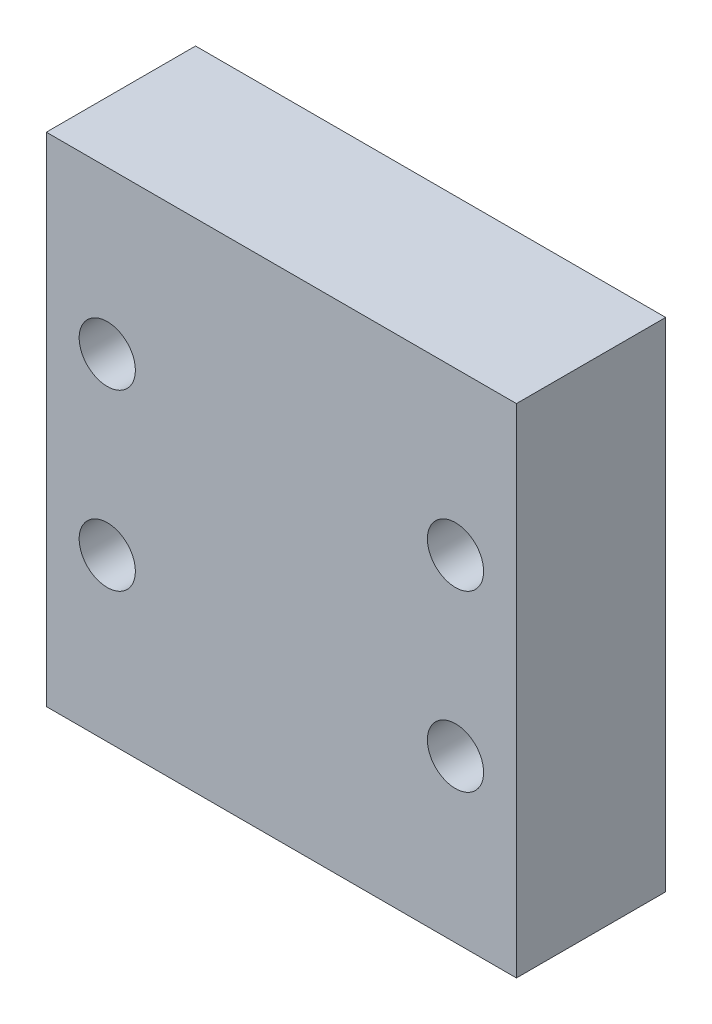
ISO-10303-21;
HEADER;
FILE_DESCRIPTION(('STEP AP214'),'2;1');
FILE_NAME('part.step','',(''),(''),'','','');
FILE_SCHEMA(('AUTOMOTIVE_DESIGN { 1 0 10303 214 1 1 1 1 }'));
ENDSEC;
DATA;
#1=APPLICATION_CONTEXT('core data for automotive mechanical design processes');
#2=APPLICATION_PROTOCOL_DEFINITION('international standard','automotive_design',2000,#1);
#3=PRODUCT_CONTEXT('',#1,'mechanical');
#4=PRODUCT('Part','Part','',(#3));
#5=PRODUCT_RELATED_PRODUCT_CATEGORY('part','',(#4));
#6=PRODUCT_DEFINITION_FORMATION('','',#4);
#7=PRODUCT_DEFINITION_CONTEXT('part definition',#1,'design');
#8=PRODUCT_DEFINITION('design','',#6,#7);
#9=PRODUCT_DEFINITION_SHAPE('','',#8);
#10=(LENGTH_UNIT() NAMED_UNIT(*) SI_UNIT(.MILLI.,.METRE.));
#11=(NAMED_UNIT(*) PLANE_ANGLE_UNIT() SI_UNIT($,.RADIAN.));
#12=(NAMED_UNIT(*) SI_UNIT($,.STERADIAN.) SOLID_ANGLE_UNIT());
#13=UNCERTAINTY_MEASURE_WITH_UNIT(LENGTH_MEASURE(1.E-05),#10,'distance_accuracy_value','');
#14=(GEOMETRIC_REPRESENTATION_CONTEXT(3) GLOBAL_UNCERTAINTY_ASSIGNED_CONTEXT((#13)) GLOBAL_UNIT_ASSIGNED_CONTEXT((#10,
#11,#12)) REPRESENTATION_CONTEXT('',''));
#15=CARTESIAN_POINT('',(0.,0.,0.));
#16=DIRECTION('',(0.,0.,1.));
#17=DIRECTION('',(1.,0.,0.));
#18=AXIS2_PLACEMENT_3D('',#15,#16,#17);
#19=CARTESIAN_POINT('',(0.,0.,6.));
#20=DIRECTION('',(0.,0.,-1.));
#21=DIRECTION('',(-1.,0.,0.));
#22=AXIS2_PLACEMENT_3D('',#19,#20,#21);
#23=PLANE('',#22);
#24=DIRECTION('',(0.,-1.,0.));
#25=VECTOR('',#24,1.);
#26=CARTESIAN_POINT('',(0.,0.,6.));
#27=LINE('',#26,#25);
#28=CARTESIAN_POINT('',(0.,20.,6.));
#29=VERTEX_POINT('',#28);
#30=CARTESIAN_POINT('',(0.,0.,6.));
#31=VERTEX_POINT('',#30);
#32=EDGE_CURVE('E85',#29,#31,#27,.T.);
#33=ORIENTED_EDGE('',*,*,#32,.T.);
#34=DIRECTION('',(1.,0.,0.));
#35=VECTOR('',#34,1.);
#36=CARTESIAN_POINT('',(0.,0.,6.));
#37=LINE('',#36,#35);
#38=CARTESIAN_POINT('',(18.9,0.,6.));
#39=VERTEX_POINT('',#38);
#40=EDGE_CURVE('E80',#31,#39,#37,.T.);
#41=ORIENTED_EDGE('',*,*,#40,.T.);
#42=DIRECTION('',(0.,1.,0.));
#43=VECTOR('',#42,1.);
#44=CARTESIAN_POINT('',(18.9,0.,6.));
#45=LINE('',#44,#43);
#46=CARTESIAN_POINT('',(18.9,20.,6.));
#47=VERTEX_POINT('',#46);
#48=EDGE_CURVE('E83',#39,#47,#45,.T.);
#49=ORIENTED_EDGE('',*,*,#48,.T.);
#50=DIRECTION('',(-1.,0.,0.));
#51=VECTOR('',#50,1.);
#52=CARTESIAN_POINT('',(0.,20.,6.));
#53=LINE('',#52,#51);
#54=EDGE_CURVE('E50',#47,#29,#53,.T.);
#55=ORIENTED_EDGE('',*,*,#54,.T.);
#56=EDGE_LOOP('',(#33,#41,#49,#55));
#57=FACE_BOUND('',#56,.T.);
#58=CARTESIAN_POINT('',(2.45,6.5,6.));
#59=DIRECTION('',(0.,0.,1.));
#60=DIRECTION('',(1.,0.,0.));
#61=AXIS2_PLACEMENT_3D('',#58,#59,#60);
#62=CIRCLE('',#61,1.13);
#63=CARTESIAN_POINT('',(3.58,6.5,6.));
#64=VERTEX_POINT('',#63);
#65=EDGE_CURVE('E100',#64,#64,#62,.T.);
#66=ORIENTED_EDGE('',*,*,#65,.F.);
#67=EDGE_LOOP('',(#66));
#68=FACE_BOUND('',#67,.T.);
#69=CARTESIAN_POINT('',(2.45,13.5,6.));
#70=DIRECTION('',(0.,0.,1.));
#71=DIRECTION('',(1.,0.,0.));
#72=AXIS2_PLACEMENT_3D('',#69,#70,#71);
#73=CIRCLE('',#72,1.13);
#74=CARTESIAN_POINT('',(3.58,13.5,6.));
#75=VERTEX_POINT('',#74);
#76=EDGE_CURVE('E115',#75,#75,#73,.T.);
#77=ORIENTED_EDGE('',*,*,#76,.F.);
#78=EDGE_LOOP('',(#77));
#79=FACE_BOUND('',#78,.T.);
#80=CARTESIAN_POINT('',(16.45,13.5,6.));
#81=DIRECTION('',(0.,0.,1.));
#82=DIRECTION('',(1.,0.,0.));
#83=AXIS2_PLACEMENT_3D('',#80,#81,#82);
#84=CIRCLE('',#83,1.13);
#85=CARTESIAN_POINT('',(17.58,13.5,6.));
#86=VERTEX_POINT('',#85);
#87=EDGE_CURVE('E121',#86,#86,#84,.T.);
#88=ORIENTED_EDGE('',*,*,#87,.F.);
#89=EDGE_LOOP('',(#88));
#90=FACE_BOUND('',#89,.T.);
#91=CARTESIAN_POINT('',(16.45,6.5,6.));
#92=DIRECTION('',(0.,0.,1.));
#93=DIRECTION('',(1.,0.,0.));
#94=AXIS2_PLACEMENT_3D('',#91,#92,#93);
#95=CIRCLE('',#94,1.13);
#96=CARTESIAN_POINT('',(17.58,6.5,6.));
#97=VERTEX_POINT('',#96);
#98=EDGE_CURVE('E127',#97,#97,#95,.T.);
#99=ORIENTED_EDGE('',*,*,#98,.F.);
#100=EDGE_LOOP('',(#99));
#101=FACE_BOUND('',#100,.T.);
#102=ADVANCED_FACE('F33',(#57,#68,#79,#90,#101),#23,.F.);
#103=CARTESIAN_POINT('',(0.,0.,0.));
#104=DIRECTION('',(0.,0.,-1.));
#105=DIRECTION('',(-1.,0.,0.));
#106=AXIS2_PLACEMENT_3D('',#103,#104,#105);
#107=PLANE('',#106);
#108=CARTESIAN_POINT('',(16.45,13.5,0.));
#109=DIRECTION('',(0.,0.,1.));
#110=DIRECTION('',(1.,0.,0.));
#111=AXIS2_PLACEMENT_3D('',#108,#109,#110);
#112=CIRCLE('',#111,1.13);
#113=CARTESIAN_POINT('',(17.58,13.5,0.));
#114=VERTEX_POINT('',#113);
#115=EDGE_CURVE('E124',#114,#114,#112,.T.);
#116=ORIENTED_EDGE('',*,*,#115,.T.);
#117=EDGE_LOOP('',(#116));
#118=FACE_BOUND('',#117,.T.);
#119=CARTESIAN_POINT('',(2.45,6.5,0.));
#120=DIRECTION('',(0.,0.,1.));
#121=DIRECTION('',(1.,0.,0.));
#122=AXIS2_PLACEMENT_3D('',#119,#120,#121);
#123=CIRCLE('',#122,1.13);
#124=CARTESIAN_POINT('',(3.58,6.5,0.));
#125=VERTEX_POINT('',#124);
#126=EDGE_CURVE('E112',#125,#125,#123,.T.);
#127=ORIENTED_EDGE('',*,*,#126,.T.);
#128=EDGE_LOOP('',(#127));
#129=FACE_BOUND('',#128,.T.);
#130=DIRECTION('',(0.,-1.,0.));
#131=VECTOR('',#130,1.);
#132=CARTESIAN_POINT('',(0.,0.,0.));
#133=LINE('',#132,#131);
#134=CARTESIAN_POINT('',(0.,20.,0.));
#135=VERTEX_POINT('',#134);
#136=CARTESIAN_POINT('',(0.,0.,0.));
#137=VERTEX_POINT('',#136);
#138=EDGE_CURVE('E97',#135,#137,#133,.T.);
#139=ORIENTED_EDGE('',*,*,#138,.F.);
#140=DIRECTION('',(-1.,0.,0.));
#141=VECTOR('',#140,1.);
#142=CARTESIAN_POINT('',(0.,20.,0.));
#143=LINE('',#142,#141);
#144=CARTESIAN_POINT('',(18.9,20.,0.));
#145=VERTEX_POINT('',#144);
#146=EDGE_CURVE('E73',#145,#135,#143,.T.);
#147=ORIENTED_EDGE('',*,*,#146,.F.);
#148=DIRECTION('',(0.,1.,0.));
#149=VECTOR('',#148,1.);
#150=CARTESIAN_POINT('',(18.9,0.,0.));
#151=LINE('',#150,#149);
#152=CARTESIAN_POINT('',(18.9,0.,0.));
#153=VERTEX_POINT('',#152);
#154=EDGE_CURVE('E67',#153,#145,#151,.T.);
#155=ORIENTED_EDGE('',*,*,#154,.F.);
#156=DIRECTION('',(1.,0.,0.));
#157=VECTOR('',#156,1.);
#158=CARTESIAN_POINT('',(0.,0.,0.));
#159=LINE('',#158,#157);
#160=EDGE_CURVE('E89',#137,#153,#159,.T.);
#161=ORIENTED_EDGE('',*,*,#160,.F.);
#162=EDGE_LOOP('',(#139,#147,#155,#161));
#163=FACE_BOUND('',#162,.T.);
#164=CARTESIAN_POINT('',(2.45,13.5,0.));
#165=DIRECTION('',(0.,0.,1.));
#166=DIRECTION('',(1.,0.,0.));
#167=AXIS2_PLACEMENT_3D('',#164,#165,#166);
#168=CIRCLE('',#167,1.13);
#169=CARTESIAN_POINT('',(3.58,13.5,0.));
#170=VERTEX_POINT('',#169);
#171=EDGE_CURVE('E118',#170,#170,#168,.T.);
#172=ORIENTED_EDGE('',*,*,#171,.T.);
#173=EDGE_LOOP('',(#172));
#174=FACE_BOUND('',#173,.T.);
#175=CARTESIAN_POINT('',(16.45,6.5,0.));
#176=DIRECTION('',(0.,0.,1.));
#177=DIRECTION('',(1.,0.,0.));
#178=AXIS2_PLACEMENT_3D('',#175,#176,#177);
#179=CIRCLE('',#178,1.13);
#180=CARTESIAN_POINT('',(17.58,6.5,0.));
#181=VERTEX_POINT('',#180);
#182=EDGE_CURVE('E130',#181,#181,#179,.T.);
#183=ORIENTED_EDGE('',*,*,#182,.T.);
#184=EDGE_LOOP('',(#183));
#185=FACE_BOUND('',#184,.T.);
#186=ADVANCED_FACE('F108',(#118,#129,#163,#174,#185),#107,.T.);
#187=CARTESIAN_POINT('',(0.,0.,6.));
#188=DIRECTION('',(1.,0.,0.));
#189=DIRECTION('',(0.,0.,-1.));
#190=AXIS2_PLACEMENT_3D('',#187,#188,#189);
#191=PLANE('',#190);
#192=ORIENTED_EDGE('',*,*,#138,.T.);
#193=DIRECTION('',(0.,0.,-1.));
#194=VECTOR('',#193,1.);
#195=CARTESIAN_POINT('',(0.,0.,6.));
#196=LINE('',#195,#194);
#197=EDGE_CURVE('E11',#31,#137,#196,.T.);
#198=ORIENTED_EDGE('',*,*,#197,.F.);
#199=ORIENTED_EDGE('',*,*,#32,.F.);
#200=DIRECTION('',(0.,0.,-1.));
#201=VECTOR('',#200,1.);
#202=CARTESIAN_POINT('',(0.,20.,6.));
#203=LINE('',#202,#201);
#204=EDGE_CURVE('E93',#29,#135,#203,.T.);
#205=ORIENTED_EDGE('',*,*,#204,.T.);
#206=EDGE_LOOP('',(#192,#198,#199,#205));
#207=FACE_BOUND('',#206,.T.);
#208=ADVANCED_FACE('F35',(#207),#191,.F.);
#209=CARTESIAN_POINT('',(0.,0.,6.));
#210=DIRECTION('',(0.,1.,0.));
#211=DIRECTION('',(0.,0.,1.));
#212=AXIS2_PLACEMENT_3D('',#209,#210,#211);
#213=PLANE('',#212);
#214=ORIENTED_EDGE('',*,*,#160,.T.);
#215=DIRECTION('',(0.,0.,-1.));
#216=VECTOR('',#215,1.);
#217=CARTESIAN_POINT('',(18.9,0.,6.));
#218=LINE('',#217,#216);
#219=EDGE_CURVE('E42',#39,#153,#218,.T.);
#220=ORIENTED_EDGE('',*,*,#219,.F.);
#221=ORIENTED_EDGE('',*,*,#40,.F.);
#222=ORIENTED_EDGE('',*,*,#197,.T.);
#223=EDGE_LOOP('',(#214,#220,#221,#222));
#224=FACE_BOUND('',#223,.T.);
#225=ADVANCED_FACE('F88',(#224),#213,.F.);
#226=CARTESIAN_POINT('',(18.9,0.,6.));
#227=DIRECTION('',(-1.,0.,0.));
#228=DIRECTION('',(0.,0.,1.));
#229=AXIS2_PLACEMENT_3D('',#226,#227,#228);
#230=PLANE('',#229);
#231=ORIENTED_EDGE('',*,*,#154,.T.);
#232=DIRECTION('',(0.,0.,-1.));
#233=VECTOR('',#232,1.);
#234=CARTESIAN_POINT('',(18.9,20.,6.));
#235=LINE('',#234,#233);
#236=EDGE_CURVE('E90',#47,#145,#235,.T.);
#237=ORIENTED_EDGE('',*,*,#236,.F.);
#238=ORIENTED_EDGE('',*,*,#48,.F.);
#239=ORIENTED_EDGE('',*,*,#219,.T.);
#240=EDGE_LOOP('',(#231,#237,#238,#239));
#241=FACE_BOUND('',#240,.T.);
#242=ADVANCED_FACE('F91',(#241),#230,.F.);
#243=CARTESIAN_POINT('',(0.,20.,6.));
#244=DIRECTION('',(0.,-1.,0.));
#245=DIRECTION('',(0.,0.,-1.));
#246=AXIS2_PLACEMENT_3D('',#243,#244,#245);
#247=PLANE('',#246);
#248=ORIENTED_EDGE('',*,*,#146,.T.);
#249=ORIENTED_EDGE('',*,*,#204,.F.);
#250=ORIENTED_EDGE('',*,*,#54,.F.);
#251=ORIENTED_EDGE('',*,*,#236,.T.);
#252=EDGE_LOOP('',(#248,#249,#250,#251));
#253=FACE_BOUND('',#252,.T.);
#254=ADVANCED_FACE('F105',(#253),#247,.F.);
#255=CARTESIAN_POINT('',(2.45,6.5,6.));
#256=DIRECTION('',(0.,0.,-1.));
#257=DIRECTION('',(-1.,0.,0.));
#258=AXIS2_PLACEMENT_3D('',#255,#256,#257);
#259=CYLINDRICAL_SURFACE('',#258,1.13);
#260=ORIENTED_EDGE('',*,*,#65,.T.);
#261=EDGE_LOOP('',(#260));
#262=FACE_BOUND('',#261,.T.);
#263=ORIENTED_EDGE('',*,*,#126,.F.);
#264=EDGE_LOOP('',(#263));
#265=FACE_BOUND('',#264,.T.);
#266=ADVANCED_FACE('F147',(#262,#265),#259,.F.);
#267=CARTESIAN_POINT('',(2.45,13.5,6.));
#268=DIRECTION('',(0.,0.,-1.));
#269=DIRECTION('',(-1.,0.,0.));
#270=AXIS2_PLACEMENT_3D('',#267,#268,#269);
#271=CYLINDRICAL_SURFACE('',#270,1.13);
#272=ORIENTED_EDGE('',*,*,#76,.T.);
#273=EDGE_LOOP('',(#272));
#274=FACE_BOUND('',#273,.T.);
#275=ORIENTED_EDGE('',*,*,#171,.F.);
#276=EDGE_LOOP('',(#275));
#277=FACE_BOUND('',#276,.T.);
#278=ADVANCED_FACE('F193',(#274,#277),#271,.F.);
#279=CARTESIAN_POINT('',(16.45,13.5,6.));
#280=DIRECTION('',(0.,0.,-1.));
#281=DIRECTION('',(-1.,0.,0.));
#282=AXIS2_PLACEMENT_3D('',#279,#280,#281);
#283=CYLINDRICAL_SURFACE('',#282,1.13);
#284=ORIENTED_EDGE('',*,*,#87,.T.);
#285=EDGE_LOOP('',(#284));
#286=FACE_BOUND('',#285,.T.);
#287=ORIENTED_EDGE('',*,*,#115,.F.);
#288=EDGE_LOOP('',(#287));
#289=FACE_BOUND('',#288,.T.);
#290=ADVANCED_FACE('F201',(#286,#289),#283,.F.);
#291=CARTESIAN_POINT('',(16.45,6.5,6.));
#292=DIRECTION('',(0.,0.,-1.));
#293=DIRECTION('',(-1.,0.,0.));
#294=AXIS2_PLACEMENT_3D('',#291,#292,#293);
#295=CYLINDRICAL_SURFACE('',#294,1.13);
#296=ORIENTED_EDGE('',*,*,#98,.T.);
#297=EDGE_LOOP('',(#296));
#298=FACE_BOUND('',#297,.T.);
#299=ORIENTED_EDGE('',*,*,#182,.F.);
#300=EDGE_LOOP('',(#299));
#301=FACE_BOUND('',#300,.T.);
#302=ADVANCED_FACE('F136',(#298,#301),#295,.F.);
#303=CLOSED_SHELL('',(#102,#186,#208,#225,#242,#254,#266,#278,#290,#302));
#304=MANIFOLD_SOLID_BREP('B2',#303);
#305=ADVANCED_BREP_SHAPE_REPRESENTATION('',(#18,#304),#14);
#306=SHAPE_DEFINITION_REPRESENTATION(#9,#305);
ENDSEC;
END-ISO-10303-21;
